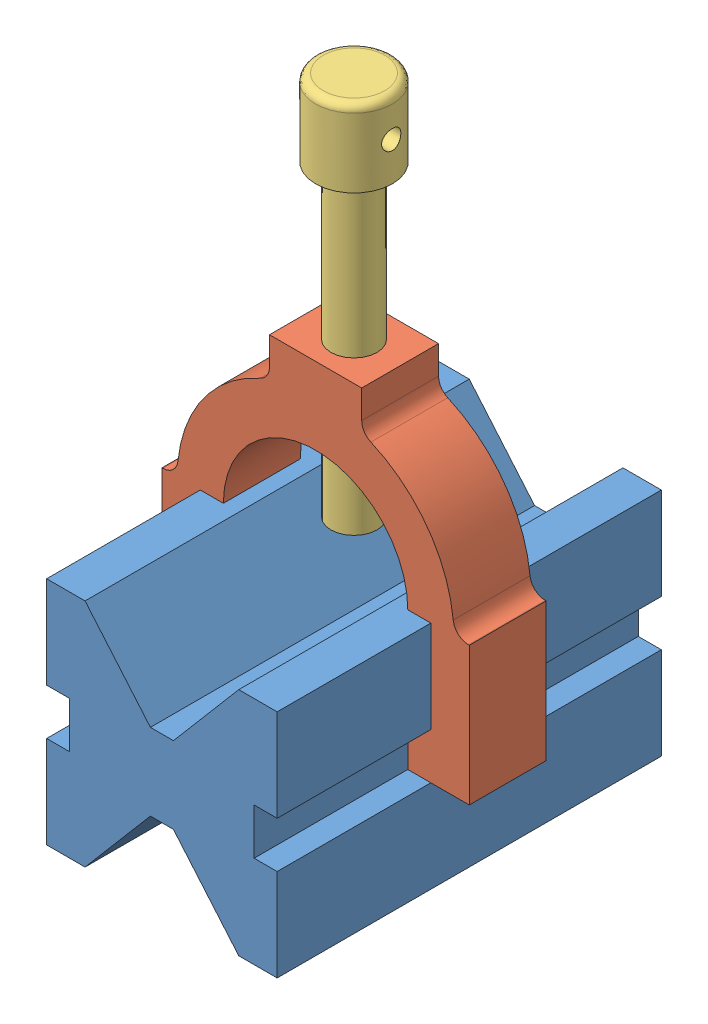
SolidWorks assembly Tutorial 1.SLDASM, configuration Default (file format 14000). Lengths in mm.
Overall size (80 164 100).
3 component instances, 3 part files, 4 mates.
Components (placement in the parent):
- V-Block Body-1: V-Block Body.SLDPRT [Default] at origin size (60 60 100)
- U-Clamp-1: U-Clamp.SLDPRT [Default] at origin size (80 80 20)
- Fastener-1: Fastener.SLDPRT [Default] at origin size (20 100 20)
Mates (geometry in assembly coordinates):
- InPlace1: in place: plane of ? through (-12 74 10) normal (0 1 0); plane of ? through (0 74 0) normal (0 1 0); moOrthogonalPlaneRef_w of ? through (-12 74 10) normal (0 1 0); plane of ? through (0 74 0) normal (0 0 -1); plane of ? through (-12 74 10) normal (0 1 0); plane of ? through (0 74 0) normal (1 0 0); plane of ? through (-12 74 10) normal (0 1 0); unknown of ?
- Coincident1: coincident aligned: plane of U-Clamp-1; plane of ?
- Coincident2: coincident aligned: moOrthogonalPlaneRef_w of U-Clamp-1 through (0 74 0) normal (0 0 -1); plane of sa^Assem1-1 through (0 74 0) normal (0 0 -1)
- Coincident3: coincident anti-aligned: moOrthogonalPlaneRef_w of U-Clamp-1 through (0 74 0) normal (-1 0 0); plane of sa^Assem1-1 through (0 74 0) normal (1 0 0)
